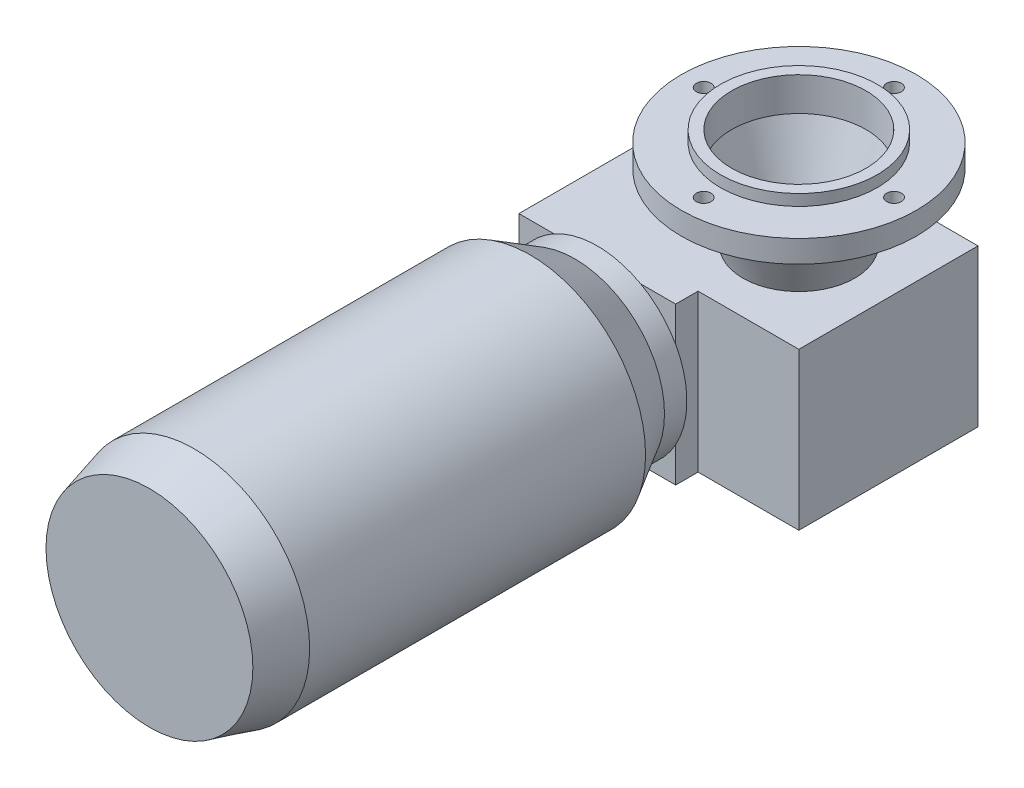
ISO-10303-21;
HEADER;
FILE_DESCRIPTION(('STEP AP214'),'2;1');
FILE_NAME('part.step','',(''),(''),'','','');
FILE_SCHEMA(('AUTOMOTIVE_DESIGN { 1 0 10303 214 1 1 1 1 }'));
ENDSEC;
DATA;
#1=APPLICATION_CONTEXT('core data for automotive mechanical design processes');
#2=APPLICATION_PROTOCOL_DEFINITION('international standard','automotive_design',2000,#1);
#3=PRODUCT_CONTEXT('',#1,'mechanical');
#4=PRODUCT('Part','Part','',(#3));
#5=PRODUCT_RELATED_PRODUCT_CATEGORY('part','',(#4));
#6=PRODUCT_DEFINITION_FORMATION('','',#4);
#7=PRODUCT_DEFINITION_CONTEXT('part definition',#1,'design');
#8=PRODUCT_DEFINITION('design','',#6,#7);
#9=PRODUCT_DEFINITION_SHAPE('','',#8);
#10=(LENGTH_UNIT() NAMED_UNIT(*) SI_UNIT(.MILLI.,.METRE.));
#11=(NAMED_UNIT(*) PLANE_ANGLE_UNIT() SI_UNIT($,.RADIAN.));
#12=(NAMED_UNIT(*) SI_UNIT($,.STERADIAN.) SOLID_ANGLE_UNIT());
#13=UNCERTAINTY_MEASURE_WITH_UNIT(LENGTH_MEASURE(1.E-05),#10,'distance_accuracy_value','');
#14=(GEOMETRIC_REPRESENTATION_CONTEXT(3) GLOBAL_UNCERTAINTY_ASSIGNED_CONTEXT((#13)) GLOBAL_UNIT_ASSIGNED_CONTEXT((#10,
#11,#12)) REPRESENTATION_CONTEXT('',''));
#15=CARTESIAN_POINT('',(0.,0.,0.));
#16=DIRECTION('',(0.,0.,1.));
#17=DIRECTION('',(1.,0.,0.));
#18=AXIS2_PLACEMENT_3D('',#15,#16,#17);
#19=CARTESIAN_POINT('',(-5.,-115.,-40.));
#20=DIRECTION('',(0.,1.,0.));
#21=DIRECTION('',(0.,0.,1.));
#22=AXIS2_PLACEMENT_3D('',#19,#20,#21);
#23=PLANE('',#22);
#24=DIRECTION('',(1.,0.,0.));
#25=VECTOR('',#24,1.);
#26=CARTESIAN_POINT('',(-5.,-115.,-40.));
#27=LINE('',#26,#25);
#28=CARTESIAN_POINT('',(-5.,-115.,-40.));
#29=VERTEX_POINT('',#28);
#30=CARTESIAN_POINT('',(40.,-115.,-40.));
#31=VERTEX_POINT('',#30);
#32=EDGE_CURVE('E197',#29,#31,#27,.T.);
#33=ORIENTED_EDGE('',*,*,#32,.T.);
#34=DIRECTION('',(0.,0.,1.));
#35=VECTOR('',#34,1.);
#36=CARTESIAN_POINT('',(40.,-115.,-40.));
#37=LINE('',#36,#35);
#38=CARTESIAN_POINT('',(40.,-115.,40.));
#39=VERTEX_POINT('',#38);
#40=EDGE_CURVE('E200',#31,#39,#37,.T.);
#41=ORIENTED_EDGE('',*,*,#40,.T.);
#42=DIRECTION('',(-1.,0.,0.));
#43=VECTOR('',#42,1.);
#44=CARTESIAN_POINT('',(40.,-115.,40.));
#45=LINE('',#44,#43);
#46=CARTESIAN_POINT('',(-5.,-115.,40.));
#47=VERTEX_POINT('',#46);
#48=EDGE_CURVE('E202',#39,#47,#45,.T.);
#49=ORIENTED_EDGE('',*,*,#48,.T.);
#50=DIRECTION('',(0.,0.,1.));
#51=VECTOR('',#50,1.);
#52=CARTESIAN_POINT('',(-5.,-115.,40.));
#53=LINE('',#52,#51);
#54=CARTESIAN_POINT('',(-5.,-115.,50.));
#55=VERTEX_POINT('',#54);
#56=EDGE_CURVE('E204',#47,#55,#53,.T.);
#57=ORIENTED_EDGE('',*,*,#56,.T.);
#58=DIRECTION('',(-1.,0.,0.));
#59=VECTOR('',#58,1.);
#60=CARTESIAN_POINT('',(-5.,-115.,50.));
#61=LINE('',#60,#59);
#62=CARTESIAN_POINT('',(-20.6350832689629,-115.,50.));
#63=VERTEX_POINT('',#62);
#64=EDGE_CURVE('E128',#55,#63,#61,.T.);
#65=ORIENTED_EDGE('',*,*,#64,.T.);
#66=CARTESIAN_POINT('',(-59.3649167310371,-115.,50.));
#67=VERTEX_POINT('',#66);
#68=EDGE_CURVE('E208',#63,#67,#61,.T.);
#69=ORIENTED_EDGE('',*,*,#68,.T.);
#70=CARTESIAN_POINT('',(-75.,-115.,50.));
#71=VERTEX_POINT('',#70);
#72=EDGE_CURVE('E55',#67,#71,#61,.T.);
#73=ORIENTED_EDGE('',*,*,#72,.T.);
#74=DIRECTION('',(0.,0.,-1.));
#75=VECTOR('',#74,1.);
#76=CARTESIAN_POINT('',(-75.,-115.,-60.));
#77=LINE('',#76,#75);
#78=CARTESIAN_POINT('',(-75.,-115.,-60.));
#79=VERTEX_POINT('',#78);
#80=EDGE_CURVE('E207',#71,#79,#77,.T.);
#81=ORIENTED_EDGE('',*,*,#80,.T.);
#82=DIRECTION('',(1.,0.,0.));
#83=VECTOR('',#82,1.);
#84=CARTESIAN_POINT('',(-4.99999999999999,-115.,-60.));
#85=LINE('',#84,#83);
#86=CARTESIAN_POINT('',(-4.99999999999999,-115.,-60.));
#87=VERTEX_POINT('',#86);
#88=EDGE_CURVE('E210',#79,#87,#85,.T.);
#89=ORIENTED_EDGE('',*,*,#88,.T.);
#90=DIRECTION('',(0.,0.,1.));
#91=VECTOR('',#90,1.);
#92=CARTESIAN_POINT('',(-5.,-115.,-40.));
#93=LINE('',#92,#91);
#94=EDGE_CURVE('E212',#87,#29,#93,.T.);
#95=ORIENTED_EDGE('',*,*,#94,.T.);
#96=EDGE_LOOP('',(#33,#41,#49,#57,#65,#69,#73,#81,#89,#95));
#97=FACE_BOUND('',#96,.T.);
#98=CARTESIAN_POINT('',(0.,-115.,0.));
#99=DIRECTION('',(0.,1.,0.));
#100=DIRECTION('',(0.,0.,1.));
#101=AXIS2_PLACEMENT_3D('',#98,#99,#100);
#102=CIRCLE('',#101,20.);
#103=CARTESIAN_POINT('',(0.,-115.,20.));
#104=VERTEX_POINT('',#103);
#105=EDGE_CURVE('E11',#104,#104,#102,.F.);
#106=ORIENTED_EDGE('',*,*,#105,.F.);
#107=EDGE_LOOP('',(#106));
#108=FACE_BOUND('',#107,.T.);
#109=ADVANCED_FACE('F32',(#97,#108),#23,.F.);
#110=CARTESIAN_POINT('',(-5.,-115.,50.));
#111=DIRECTION('',(0.,0.,-1.));
#112=DIRECTION('',(-1.,0.,0.));
#113=AXIS2_PLACEMENT_3D('',#110,#111,#112);
#114=PLANE('',#113);
#115=CARTESIAN_POINT('',(-40.,-80.,50.));
#116=DIRECTION('',(0.,0.,1.));
#117=DIRECTION('',(1.,0.,0.));
#118=AXIS2_PLACEMENT_3D('',#115,#116,#117);
#119=CIRCLE('',#118,40.);
#120=CARTESIAN_POINT('',(-5.,-60.6350832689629,50.));
#121=VERTEX_POINT('',#120);
#122=CARTESIAN_POINT('',(-20.6350832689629,-45.,50.));
#123=VERTEX_POINT('',#122);
#124=EDGE_CURVE('E47',#121,#123,#119,.T.);
#125=ORIENTED_EDGE('',*,*,#124,.F.);
#126=DIRECTION('',(0.,1.,0.));
#127=VECTOR('',#126,1.);
#128=CARTESIAN_POINT('',(-5.,-115.,50.));
#129=LINE('',#128,#127);
#130=CARTESIAN_POINT('',(-5.,-45.,50.));
#131=VERTEX_POINT('',#130);
#132=EDGE_CURVE('E134',#121,#131,#129,.T.);
#133=ORIENTED_EDGE('',*,*,#132,.T.);
#134=DIRECTION('',(-1.,0.,0.));
#135=VECTOR('',#134,1.);
#136=CARTESIAN_POINT('',(-5.,-45.,50.));
#137=LINE('',#136,#135);
#138=EDGE_CURVE('E186',#131,#123,#137,.T.);
#139=ORIENTED_EDGE('',*,*,#138,.T.);
#140=EDGE_LOOP('',(#125,#133,#139));
#141=FACE_BOUND('',#140,.T.);
#142=ADVANCED_FACE('F336',(#141),#114,.F.);
#143=CARTESIAN_POINT('',(-59.3649167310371,-45.,50.));
#144=VERTEX_POINT('',#143);
#145=CARTESIAN_POINT('',(-75.,-60.6350832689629,50.));
#146=VERTEX_POINT('',#145);
#147=EDGE_CURVE('E40',#144,#146,#119,.T.);
#148=ORIENTED_EDGE('',*,*,#147,.F.);
#149=CARTESIAN_POINT('',(-75.,-45.,50.));
#150=VERTEX_POINT('',#149);
#151=EDGE_CURVE('E171',#144,#150,#137,.T.);
#152=ORIENTED_EDGE('',*,*,#151,.T.);
#153=DIRECTION('',(0.,1.,0.));
#154=VECTOR('',#153,1.);
#155=CARTESIAN_POINT('',(-75.,-115.,50.));
#156=LINE('',#155,#154);
#157=EDGE_CURVE('E173',#146,#150,#156,.T.);
#158=ORIENTED_EDGE('',*,*,#157,.F.);
#159=EDGE_LOOP('',(#148,#152,#158));
#160=FACE_BOUND('',#159,.T.);
#161=ADVANCED_FACE('F170',(#160),#114,.F.);
#162=CARTESIAN_POINT('',(-75.,-99.3649167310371,50.));
#163=VERTEX_POINT('',#162);
#164=EDGE_CURVE('E151',#163,#67,#119,.T.);
#165=ORIENTED_EDGE('',*,*,#164,.F.);
#166=EDGE_CURVE('E223',#71,#163,#156,.T.);
#167=ORIENTED_EDGE('',*,*,#166,.F.);
#168=ORIENTED_EDGE('',*,*,#72,.F.);
#169=EDGE_LOOP('',(#165,#167,#168));
#170=FACE_BOUND('',#169,.T.);
#171=ADVANCED_FACE('F492',(#170),#114,.F.);
#172=CARTESIAN_POINT('',(-5.,-99.3649167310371,50.));
#173=VERTEX_POINT('',#172);
#174=EDGE_CURVE('E126',#63,#173,#119,.T.);
#175=ORIENTED_EDGE('',*,*,#174,.F.);
#176=ORIENTED_EDGE('',*,*,#64,.F.);
#177=EDGE_CURVE('E122',#55,#173,#129,.T.);
#178=ORIENTED_EDGE('',*,*,#177,.T.);
#179=EDGE_LOOP('',(#175,#176,#178));
#180=FACE_BOUND('',#179,.T.);
#181=ADVANCED_FACE('F124',(#180),#114,.F.);
#182=CARTESIAN_POINT('',(35.,-5.,0.));
#183=DIRECTION('',(0.,-1.,0.));
#184=DIRECTION('',(0.,0.,-1.));
#185=AXIS2_PLACEMENT_3D('',#182,#183,#184);
#186=PLANE('',#185);
#187=CARTESIAN_POINT('',(42.5,-5.,0.));
#188=DIRECTION('',(0.,1.,0.));
#189=DIRECTION('',(0.,0.,1.));
#190=AXIS2_PLACEMENT_3D('',#187,#188,#189);
#191=CIRCLE('',#190,3.29999999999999);
#192=CARTESIAN_POINT('',(42.5,-5.,3.29999999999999));
#193=VERTEX_POINT('',#192);
#194=EDGE_CURVE('E244',#193,#193,#191,.T.);
#195=ORIENTED_EDGE('',*,*,#194,.F.);
#196=EDGE_LOOP('',(#195));
#197=FACE_BOUND('',#196,.T.);
#198=CARTESIAN_POINT('',(0.,-5.,42.5));
#199=DIRECTION('',(0.,1.,0.));
#200=DIRECTION('',(0.,0.,1.));
#201=AXIS2_PLACEMENT_3D('',#198,#199,#200);
#202=CIRCLE('',#201,3.29999999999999);
#203=CARTESIAN_POINT('',(0.,-5.,45.8));
#204=VERTEX_POINT('',#203);
#205=EDGE_CURVE('E256',#204,#204,#202,.T.);
#206=ORIENTED_EDGE('',*,*,#205,.F.);
#207=EDGE_LOOP('',(#206));
#208=FACE_BOUND('',#207,.T.);
#209=CARTESIAN_POINT('',(0.,-5.,0.));
#210=DIRECTION('',(0.,1.,0.));
#211=DIRECTION('',(0.,0.,1.));
#212=AXIS2_PLACEMENT_3D('',#209,#210,#211);
#213=CIRCLE('',#212,35.);
#214=CARTESIAN_POINT('',(0.,-5.,35.));
#215=VERTEX_POINT('',#214);
#216=EDGE_CURVE('E268',#215,#215,#213,.T.);
#217=ORIENTED_EDGE('',*,*,#216,.F.);
#218=EDGE_LOOP('',(#217));
#219=FACE_BOUND('',#218,.T.);
#220=CARTESIAN_POINT('',(0.,-5.,0.));
#221=DIRECTION('',(0.,1.,0.));
#222=DIRECTION('',(0.,0.,1.));
#223=AXIS2_PLACEMENT_3D('',#220,#221,#222);
#224=CIRCLE('',#223,52.5);
#225=CARTESIAN_POINT('',(0.,-5.,52.5));
#226=VERTEX_POINT('',#225);
#227=EDGE_CURVE('E271',#226,#226,#224,.T.);
#228=ORIENTED_EDGE('',*,*,#227,.T.);
#229=EDGE_LOOP('',(#228));
#230=FACE_BOUND('',#229,.T.);
#231=CARTESIAN_POINT('',(0.,-5.,-42.5));
#232=DIRECTION('',(0.,1.,0.));
#233=DIRECTION('',(0.,0.,1.));
#234=AXIS2_PLACEMENT_3D('',#231,#232,#233);
#235=CIRCLE('',#234,3.29999999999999);
#236=CARTESIAN_POINT('',(0.,-5.,-39.2));
#237=VERTEX_POINT('',#236);
#238=EDGE_CURVE('E250',#237,#237,#235,.T.);
#239=ORIENTED_EDGE('',*,*,#238,.F.);
#240=EDGE_LOOP('',(#239));
#241=FACE_BOUND('',#240,.T.);
#242=CARTESIAN_POINT('',(-42.5,-5.,0.));
#243=DIRECTION('',(0.,1.,0.));
#244=DIRECTION('',(0.,0.,1.));
#245=AXIS2_PLACEMENT_3D('',#242,#243,#244);
#246=CIRCLE('',#245,3.29999999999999);
#247=CARTESIAN_POINT('',(-42.5,-5.,3.29999999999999));
#248=VERTEX_POINT('',#247);
#249=EDGE_CURVE('E238',#248,#248,#246,.T.);
#250=ORIENTED_EDGE('',*,*,#249,.F.);
#251=EDGE_LOOP('',(#250));
#252=FACE_BOUND('',#251,.T.);
#253=ADVANCED_FACE('F292',(#197,#208,#219,#230,#241,#252),#186,.F.);
#254=CARTESIAN_POINT('',(0.,32.3842170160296,0.));
#255=DIRECTION('',(0.,1.,0.));
#256=DIRECTION('',(0.,0.,1.));
#257=AXIS2_PLACEMENT_3D('',#254,#255,#256);
#258=CYLINDRICAL_SURFACE('',#257,30.);
#259=CARTESIAN_POINT('',(0.,-15.,0.));
#260=DIRECTION('',(0.,1.,0.));
#261=DIRECTION('',(0.,0.,1.));
#262=AXIS2_PLACEMENT_3D('',#259,#260,#261);
#263=CIRCLE('',#262,30.);
#264=CARTESIAN_POINT('',(0.,-15.,30.));
#265=VERTEX_POINT('',#264);
#266=EDGE_CURVE('E152',#265,#265,#263,.T.);
#267=ORIENTED_EDGE('',*,*,#266,.F.);
#268=EDGE_LOOP('',(#267));
#269=FACE_BOUND('',#268,.T.);
#270=CARTESIAN_POINT('',(0.,0.,0.));
#271=DIRECTION('',(0.,1.,0.));
#272=DIRECTION('',(0.,0.,1.));
#273=AXIS2_PLACEMENT_3D('',#270,#271,#272);
#274=CIRCLE('',#273,30.);
#275=CARTESIAN_POINT('',(0.,0.,30.));
#276=VERTEX_POINT('',#275);
#277=EDGE_CURVE('E262',#276,#276,#274,.T.);
#278=ORIENTED_EDGE('',*,*,#277,.T.);
#279=EDGE_LOOP('',(#278));
#280=FACE_BOUND('',#279,.T.);
#281=ADVANCED_FACE('F34',(#269,#280),#258,.F.);
#282=CARTESIAN_POINT('',(0.,-15.,0.));
#283=DIRECTION('',(0.,1.,0.));
#284=DIRECTION('',(0.,0.,1.));
#285=AXIS2_PLACEMENT_3D('',#282,#283,#284);
#286=CONICAL_SURFACE('',#285,30.,0.345555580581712);
#287=CARTESIAN_POINT('',(0.,-40.,0.));
#288=DIRECTION('',(0.,1.,0.));
#289=DIRECTION('',(0.,0.,1.));
#290=AXIS2_PLACEMENT_3D('',#287,#288,#289);
#291=CIRCLE('',#290,21.);
#292=CARTESIAN_POINT('',(0.,-40.,21.));
#293=VERTEX_POINT('',#292);
#294=EDGE_CURVE('E154',#293,#293,#291,.T.);
#295=ORIENTED_EDGE('',*,*,#294,.F.);
#296=EDGE_LOOP('',(#295));
#297=FACE_BOUND('',#296,.T.);
#298=ORIENTED_EDGE('',*,*,#266,.T.);
#299=EDGE_LOOP('',(#298));
#300=FACE_BOUND('',#299,.T.);
#301=ADVANCED_FACE('F285',(#297,#300),#286,.F.);
#302=CARTESIAN_POINT('',(0.,-40.,0.));
#303=DIRECTION('',(0.,-1.,0.));
#304=DIRECTION('',(0.,0.,-1.));
#305=AXIS2_PLACEMENT_3D('',#302,#303,#304);
#306=PLANE('',#305);
#307=ORIENTED_EDGE('',*,*,#294,.T.);
#308=EDGE_LOOP('',(#307));
#309=FACE_BOUND('',#308,.T.);
#310=ADVANCED_FACE('F283',(#309),#306,.F.);
#311=CARTESIAN_POINT('',(0.,-45.,0.));
#312=DIRECTION('',(0.,1.,0.));
#313=DIRECTION('',(0.,0.,1.));
#314=AXIS2_PLACEMENT_3D('',#311,#312,#313);
#315=CONICAL_SURFACE('',#314,25.,0.345555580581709);
#316=CARTESIAN_POINT('',(0.,-15.0000000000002,0.));
#317=DIRECTION('',(0.,1.,0.));
#318=DIRECTION('',(0.,0.,1.));
#319=AXIS2_PLACEMENT_3D('',#316,#317,#318);
#320=CIRCLE('',#319,35.7999999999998);
#321=CARTESIAN_POINT('',(0.,-15.0000000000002,35.7999999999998));
#322=VERTEX_POINT('',#321);
#323=EDGE_CURVE('E277',#322,#322,#320,.T.);
#324=ORIENTED_EDGE('',*,*,#323,.F.);
#325=EDGE_LOOP('',(#324));
#326=FACE_BOUND('',#325,.T.);
#327=CARTESIAN_POINT('',(0.,-45.,0.));
#328=DIRECTION('',(0.,1.,0.));
#329=DIRECTION('',(0.,0.,1.));
#330=AXIS2_PLACEMENT_3D('',#327,#328,#329);
#331=CIRCLE('',#330,25.);
#332=CARTESIAN_POINT('',(0.,-45.,25.));
#333=VERTEX_POINT('',#332);
#334=EDGE_CURVE('E235',#333,#333,#331,.T.);
#335=ORIENTED_EDGE('',*,*,#334,.T.);
#336=EDGE_LOOP('',(#335));
#337=FACE_BOUND('',#336,.T.);
#338=ADVANCED_FACE('F535',(#326,#337),#315,.T.);
#339=CARTESIAN_POINT('',(52.5,-15.,0.));
#340=DIRECTION('',(0.,1.,0.));
#341=DIRECTION('',(0.,0.,1.));
#342=AXIS2_PLACEMENT_3D('',#339,#340,#341);
#343=PLANE('',#342);
#344=CARTESIAN_POINT('',(-42.5,-15.,0.));
#345=DIRECTION('',(0.,1.,0.));
#346=DIRECTION('',(0.,0.,1.));
#347=AXIS2_PLACEMENT_3D('',#344,#345,#346);
#348=CIRCLE('',#347,3.29999999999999);
#349=CARTESIAN_POINT('',(-42.5,-15.,3.29999999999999));
#350=VERTEX_POINT('',#349);
#351=EDGE_CURVE('E241',#350,#350,#348,.T.);
#352=ORIENTED_EDGE('',*,*,#351,.T.);
#353=EDGE_LOOP('',(#352));
#354=FACE_BOUND('',#353,.T.);
#355=CARTESIAN_POINT('',(42.5,-15.,0.));
#356=DIRECTION('',(0.,1.,0.));
#357=DIRECTION('',(0.,0.,1.));
#358=AXIS2_PLACEMENT_3D('',#355,#356,#357);
#359=CIRCLE('',#358,3.29999999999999);
#360=CARTESIAN_POINT('',(42.5,-15.,3.29999999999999));
#361=VERTEX_POINT('',#360);
#362=EDGE_CURVE('E247',#361,#361,#359,.T.);
#363=ORIENTED_EDGE('',*,*,#362,.T.);
#364=EDGE_LOOP('',(#363));
#365=FACE_BOUND('',#364,.T.);
#366=CARTESIAN_POINT('',(0.,-15.,-42.5));
#367=DIRECTION('',(0.,1.,0.));
#368=DIRECTION('',(0.,0.,1.));
#369=AXIS2_PLACEMENT_3D('',#366,#367,#368);
#370=CIRCLE('',#369,3.29999999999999);
#371=CARTESIAN_POINT('',(0.,-15.,-39.2));
#372=VERTEX_POINT('',#371);
#373=EDGE_CURVE('E253',#372,#372,#370,.T.);
#374=ORIENTED_EDGE('',*,*,#373,.T.);
#375=EDGE_LOOP('',(#374));
#376=FACE_BOUND('',#375,.T.);
#377=CARTESIAN_POINT('',(0.,-15.,42.5));
#378=DIRECTION('',(0.,1.,0.));
#379=DIRECTION('',(0.,0.,1.));
#380=AXIS2_PLACEMENT_3D('',#377,#378,#379);
#381=CIRCLE('',#380,3.29999999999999);
#382=CARTESIAN_POINT('',(0.,-15.,45.8));
#383=VERTEX_POINT('',#382);
#384=EDGE_CURVE('E259',#383,#383,#381,.T.);
#385=ORIENTED_EDGE('',*,*,#384,.T.);
#386=EDGE_LOOP('',(#385));
#387=FACE_BOUND('',#386,.T.);
#388=CARTESIAN_POINT('',(0.,-15.,0.));
#389=DIRECTION('',(0.,1.,0.));
#390=DIRECTION('',(0.,0.,1.));
#391=AXIS2_PLACEMENT_3D('',#388,#389,#390);
#392=CIRCLE('',#391,52.5);
#393=CARTESIAN_POINT('',(0.,-15.,52.5));
#394=VERTEX_POINT('',#393);
#395=EDGE_CURVE('E274',#394,#394,#392,.T.);
#396=ORIENTED_EDGE('',*,*,#395,.F.);
#397=EDGE_LOOP('',(#396));
#398=FACE_BOUND('',#397,.T.);
#399=ORIENTED_EDGE('',*,*,#323,.T.);
#400=EDGE_LOOP('',(#399));
#401=FACE_BOUND('',#400,.T.);
#402=ADVANCED_FACE('F544',(#354,#365,#376,#387,#398,#401),#343,.F.);
#403=CARTESIAN_POINT('',(0.,32.3842170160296,0.));
#404=DIRECTION('',(0.,1.,0.));
#405=DIRECTION('',(0.,0.,1.));
#406=AXIS2_PLACEMENT_3D('',#403,#404,#405);
#407=CYLINDRICAL_SURFACE('',#406,52.5);
#408=ORIENTED_EDGE('',*,*,#227,.F.);
#409=EDGE_LOOP('',(#408));
#410=FACE_BOUND('',#409,.T.);
#411=ORIENTED_EDGE('',*,*,#395,.T.);
#412=EDGE_LOOP('',(#411));
#413=FACE_BOUND('',#412,.T.);
#414=ADVANCED_FACE('F305',(#410,#413),#407,.T.);
#415=CARTESIAN_POINT('',(0.,32.3842170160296,0.));
#416=DIRECTION('',(0.,1.,0.));
#417=DIRECTION('',(0.,0.,1.));
#418=AXIS2_PLACEMENT_3D('',#415,#416,#417);
#419=CYLINDRICAL_SURFACE('',#418,35.);
#420=CARTESIAN_POINT('',(0.,0.,0.));
#421=DIRECTION('',(0.,1.,0.));
#422=DIRECTION('',(0.,0.,1.));
#423=AXIS2_PLACEMENT_3D('',#420,#421,#422);
#424=CIRCLE('',#423,35.);
#425=CARTESIAN_POINT('',(0.,0.,35.));
#426=VERTEX_POINT('',#425);
#427=EDGE_CURVE('E265',#426,#426,#424,.T.);
#428=ORIENTED_EDGE('',*,*,#427,.F.);
#429=EDGE_LOOP('',(#428));
#430=FACE_BOUND('',#429,.T.);
#431=ORIENTED_EDGE('',*,*,#216,.T.);
#432=EDGE_LOOP('',(#431));
#433=FACE_BOUND('',#432,.T.);
#434=ADVANCED_FACE('F299',(#430,#433),#419,.T.);
#435=CARTESIAN_POINT('',(30.,0.,0.));
#436=DIRECTION('',(0.,-1.,0.));
#437=DIRECTION('',(0.,0.,-1.));
#438=AXIS2_PLACEMENT_3D('',#435,#436,#437);
#439=PLANE('',#438);
#440=ORIENTED_EDGE('',*,*,#277,.F.);
#441=EDGE_LOOP('',(#440));
#442=FACE_BOUND('',#441,.T.);
#443=ORIENTED_EDGE('',*,*,#427,.T.);
#444=EDGE_LOOP('',(#443));
#445=FACE_BOUND('',#444,.T.);
#446=ADVANCED_FACE('F295',(#442,#445),#439,.F.);
#447=CARTESIAN_POINT('',(0.,-5.,42.5));
#448=DIRECTION('',(0.,1.,0.));
#449=DIRECTION('',(0.,0.,1.));
#450=AXIS2_PLACEMENT_3D('',#447,#448,#449);
#451=CYLINDRICAL_SURFACE('',#450,3.29999999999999);
#452=ORIENTED_EDGE('',*,*,#384,.F.);
#453=EDGE_LOOP('',(#452));
#454=FACE_BOUND('',#453,.T.);
#455=ORIENTED_EDGE('',*,*,#205,.T.);
#456=EDGE_LOOP('',(#455));
#457=FACE_BOUND('',#456,.T.);
#458=ADVANCED_FACE('F298',(#454,#457),#451,.F.);
#459=CARTESIAN_POINT('',(0.,-5.,-42.5));
#460=DIRECTION('',(0.,1.,0.));
#461=DIRECTION('',(0.,0.,1.));
#462=AXIS2_PLACEMENT_3D('',#459,#460,#461);
#463=CYLINDRICAL_SURFACE('',#462,3.29999999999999);
#464=ORIENTED_EDGE('',*,*,#373,.F.);
#465=EDGE_LOOP('',(#464));
#466=FACE_BOUND('',#465,.T.);
#467=ORIENTED_EDGE('',*,*,#238,.T.);
#468=EDGE_LOOP('',(#467));
#469=FACE_BOUND('',#468,.T.);
#470=ADVANCED_FACE('F330',(#466,#469),#463,.F.);
#471=CARTESIAN_POINT('',(42.5,-5.,0.));
#472=DIRECTION('',(0.,1.,0.));
#473=DIRECTION('',(0.,0.,1.));
#474=AXIS2_PLACEMENT_3D('',#471,#472,#473);
#475=CYLINDRICAL_SURFACE('',#474,3.29999999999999);
#476=ORIENTED_EDGE('',*,*,#362,.F.);
#477=EDGE_LOOP('',(#476));
#478=FACE_BOUND('',#477,.T.);
#479=ORIENTED_EDGE('',*,*,#194,.T.);
#480=EDGE_LOOP('',(#479));
#481=FACE_BOUND('',#480,.T.);
#482=ADVANCED_FACE('F321',(#478,#481),#475,.F.);
#483=CARTESIAN_POINT('',(-42.5,-5.,0.));
#484=DIRECTION('',(0.,1.,0.));
#485=DIRECTION('',(0.,0.,1.));
#486=AXIS2_PLACEMENT_3D('',#483,#484,#485);
#487=CYLINDRICAL_SURFACE('',#486,3.29999999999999);
#488=ORIENTED_EDGE('',*,*,#351,.F.);
#489=EDGE_LOOP('',(#488));
#490=FACE_BOUND('',#489,.T.);
#491=ORIENTED_EDGE('',*,*,#249,.T.);
#492=EDGE_LOOP('',(#491));
#493=FACE_BOUND('',#492,.T.);
#494=ADVANCED_FACE('F319',(#490,#493),#487,.F.);
#495=CARTESIAN_POINT('',(-5.,-45.,-40.));
#496=DIRECTION('',(0.,1.,0.));
#497=DIRECTION('',(0.,0.,1.));
#498=AXIS2_PLACEMENT_3D('',#495,#496,#497);
#499=PLANE('',#498);
#500=DIRECTION('',(1.,0.,0.));
#501=VECTOR('',#500,1.);
#502=CARTESIAN_POINT('',(-5.,-45.,-40.));
#503=LINE('',#502,#501);
#504=CARTESIAN_POINT('',(-5.,-45.,-40.));
#505=VERTEX_POINT('',#504);
#506=CARTESIAN_POINT('',(40.,-45.,-40.));
#507=VERTEX_POINT('',#506);
#508=EDGE_CURVE('E161',#505,#507,#503,.T.);
#509=ORIENTED_EDGE('',*,*,#508,.F.);
#510=DIRECTION('',(0.,0.,1.));
#511=VECTOR('',#510,1.);
#512=CARTESIAN_POINT('',(-5.,-45.,-40.));
#513=LINE('',#512,#511);
#514=CARTESIAN_POINT('',(-4.99999999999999,-45.,-60.));
#515=VERTEX_POINT('',#514);
#516=EDGE_CURVE('E195',#515,#505,#513,.T.);
#517=ORIENTED_EDGE('',*,*,#516,.F.);
#518=DIRECTION('',(1.,0.,0.));
#519=VECTOR('',#518,1.);
#520=CARTESIAN_POINT('',(-4.99999999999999,-45.,-60.));
#521=LINE('',#520,#519);
#522=CARTESIAN_POINT('',(-75.,-45.,-60.));
#523=VERTEX_POINT('',#522);
#524=EDGE_CURVE('E193',#523,#515,#521,.T.);
#525=ORIENTED_EDGE('',*,*,#524,.F.);
#526=DIRECTION('',(0.,0.,-1.));
#527=VECTOR('',#526,1.);
#528=CARTESIAN_POINT('',(-75.,-45.,-60.));
#529=LINE('',#528,#527);
#530=EDGE_CURVE('E183',#150,#523,#529,.T.);
#531=ORIENTED_EDGE('',*,*,#530,.F.);
#532=ORIENTED_EDGE('',*,*,#151,.F.);
#533=EDGE_CURVE('E181',#123,#144,#137,.T.);
#534=ORIENTED_EDGE('',*,*,#533,.F.);
#535=ORIENTED_EDGE('',*,*,#138,.F.);
#536=DIRECTION('',(0.,0.,1.));
#537=VECTOR('',#536,1.);
#538=CARTESIAN_POINT('',(-5.,-45.,40.));
#539=LINE('',#538,#537);
#540=CARTESIAN_POINT('',(-5.,-45.,40.));
#541=VERTEX_POINT('',#540);
#542=EDGE_CURVE('E184',#541,#131,#539,.T.);
#543=ORIENTED_EDGE('',*,*,#542,.F.);
#544=DIRECTION('',(-1.,0.,0.));
#545=VECTOR('',#544,1.);
#546=CARTESIAN_POINT('',(40.,-45.,40.));
#547=LINE('',#546,#545);
#548=CARTESIAN_POINT('',(40.,-45.,40.));
#549=VERTEX_POINT('',#548);
#550=EDGE_CURVE('E378',#549,#541,#547,.T.);
#551=ORIENTED_EDGE('',*,*,#550,.F.);
#552=DIRECTION('',(0.,0.,1.));
#553=VECTOR('',#552,1.);
#554=CARTESIAN_POINT('',(40.,-45.,-40.));
#555=LINE('',#554,#553);
#556=EDGE_CURVE('E376',#507,#549,#555,.T.);
#557=ORIENTED_EDGE('',*,*,#556,.F.);
#558=EDGE_LOOP('',(#509,#517,#525,#531,#532,#534,#535,#543,#551,#557));
#559=FACE_BOUND('',#558,.T.);
#560=ORIENTED_EDGE('',*,*,#334,.F.);
#561=EDGE_LOOP('',(#560));
#562=FACE_BOUND('',#561,.T.);
#563=ADVANCED_FACE('F178',(#559,#562),#499,.T.);
#564=CARTESIAN_POINT('',(-5.,-115.,-40.));
#565=DIRECTION('',(0.,0.,1.));
#566=DIRECTION('',(1.,0.,0.));
#567=AXIS2_PLACEMENT_3D('',#564,#565,#566);
#568=PLANE('',#567);
#569=ORIENTED_EDGE('',*,*,#508,.T.);
#570=DIRECTION('',(0.,1.,0.));
#571=VECTOR('',#570,1.);
#572=CARTESIAN_POINT('',(40.,-115.,-40.));
#573=LINE('',#572,#571);
#574=EDGE_CURVE('E232',#31,#507,#573,.T.);
#575=ORIENTED_EDGE('',*,*,#574,.F.);
#576=ORIENTED_EDGE('',*,*,#32,.F.);
#577=DIRECTION('',(0.,1.,0.));
#578=VECTOR('',#577,1.);
#579=CARTESIAN_POINT('',(-5.,-115.,-40.));
#580=LINE('',#579,#578);
#581=EDGE_CURVE('E214',#29,#505,#580,.T.);
#582=ORIENTED_EDGE('',*,*,#581,.T.);
#583=EDGE_LOOP('',(#569,#575,#576,#582));
#584=FACE_BOUND('',#583,.T.);
#585=ADVANCED_FACE('F328',(#584),#568,.F.);
#586=CARTESIAN_POINT('',(40.,-115.,-40.));
#587=DIRECTION('',(-1.,0.,0.));
#588=DIRECTION('',(0.,0.,1.));
#589=AXIS2_PLACEMENT_3D('',#586,#587,#588);
#590=PLANE('',#589);
#591=ORIENTED_EDGE('',*,*,#556,.T.);
#592=DIRECTION('',(0.,1.,0.));
#593=VECTOR('',#592,1.);
#594=CARTESIAN_POINT('',(40.,-115.,40.));
#595=LINE('',#594,#593);
#596=EDGE_CURVE('E229',#39,#549,#595,.T.);
#597=ORIENTED_EDGE('',*,*,#596,.F.);
#598=ORIENTED_EDGE('',*,*,#40,.F.);
#599=ORIENTED_EDGE('',*,*,#574,.T.);
#600=EDGE_LOOP('',(#591,#597,#598,#599));
#601=FACE_BOUND('',#600,.T.);
#602=ADVANCED_FACE('F363',(#601),#590,.F.);
#603=CARTESIAN_POINT('',(40.,-115.,40.));
#604=DIRECTION('',(0.,0.,-1.));
#605=DIRECTION('',(-1.,0.,0.));
#606=AXIS2_PLACEMENT_3D('',#603,#604,#605);
#607=PLANE('',#606);
#608=ORIENTED_EDGE('',*,*,#550,.T.);
#609=DIRECTION('',(0.,1.,0.));
#610=VECTOR('',#609,1.);
#611=CARTESIAN_POINT('',(-5.,-115.,40.));
#612=LINE('',#611,#610);
#613=EDGE_CURVE('E131',#47,#541,#612,.T.);
#614=ORIENTED_EDGE('',*,*,#613,.F.);
#615=ORIENTED_EDGE('',*,*,#48,.F.);
#616=ORIENTED_EDGE('',*,*,#596,.T.);
#617=EDGE_LOOP('',(#608,#614,#615,#616));
#618=FACE_BOUND('',#617,.T.);
#619=ADVANCED_FACE('F360',(#618),#607,.F.);
#620=CARTESIAN_POINT('',(-5.,-115.,40.));
#621=DIRECTION('',(-1.,0.,0.));
#622=DIRECTION('',(0.,0.,1.));
#623=AXIS2_PLACEMENT_3D('',#620,#621,#622);
#624=PLANE('',#623);
#625=ORIENTED_EDGE('',*,*,#542,.T.);
#626=ORIENTED_EDGE('',*,*,#132,.F.);
#627=EDGE_CURVE('E132',#173,#121,#129,.T.);
#628=ORIENTED_EDGE('',*,*,#627,.F.);
#629=ORIENTED_EDGE('',*,*,#177,.F.);
#630=ORIENTED_EDGE('',*,*,#56,.F.);
#631=ORIENTED_EDGE('',*,*,#613,.T.);
#632=EDGE_LOOP('',(#625,#626,#628,#629,#630,#631));
#633=FACE_BOUND('',#632,.T.);
#634=ADVANCED_FACE('F138',(#633),#624,.F.);
#635=CARTESIAN_POINT('',(-75.,-115.,-60.));
#636=DIRECTION('',(1.,0.,0.));
#637=DIRECTION('',(0.,0.,-1.));
#638=AXIS2_PLACEMENT_3D('',#635,#636,#637);
#639=PLANE('',#638);
#640=ORIENTED_EDGE('',*,*,#530,.T.);
#641=DIRECTION('',(0.,1.,0.));
#642=VECTOR('',#641,1.);
#643=CARTESIAN_POINT('',(-75.,-115.,-60.));
#644=LINE('',#643,#642);
#645=EDGE_CURVE('E220',#79,#523,#644,.T.);
#646=ORIENTED_EDGE('',*,*,#645,.F.);
#647=ORIENTED_EDGE('',*,*,#80,.F.);
#648=ORIENTED_EDGE('',*,*,#166,.T.);
#649=EDGE_CURVE('E225',#163,#146,#156,.T.);
#650=ORIENTED_EDGE('',*,*,#649,.T.);
#651=ORIENTED_EDGE('',*,*,#157,.T.);
#652=EDGE_LOOP('',(#640,#646,#647,#648,#650,#651));
#653=FACE_BOUND('',#652,.T.);
#654=ADVANCED_FACE('F353',(#653),#639,.F.);
#655=CARTESIAN_POINT('',(-4.99999999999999,-115.,-60.));
#656=DIRECTION('',(0.,0.,1.));
#657=DIRECTION('',(1.,0.,0.));
#658=AXIS2_PLACEMENT_3D('',#655,#656,#657);
#659=PLANE('',#658);
#660=ORIENTED_EDGE('',*,*,#524,.T.);
#661=DIRECTION('',(0.,1.,0.));
#662=VECTOR('',#661,1.);
#663=CARTESIAN_POINT('',(-4.99999999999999,-115.,-60.));
#664=LINE('',#663,#662);
#665=EDGE_CURVE('E217',#87,#515,#664,.T.);
#666=ORIENTED_EDGE('',*,*,#665,.F.);
#667=ORIENTED_EDGE('',*,*,#88,.F.);
#668=ORIENTED_EDGE('',*,*,#645,.T.);
#669=EDGE_LOOP('',(#660,#666,#667,#668));
#670=FACE_BOUND('',#669,.T.);
#671=ADVANCED_FACE('F349',(#670),#659,.F.);
#672=CARTESIAN_POINT('',(-5.,-115.,-40.));
#673=DIRECTION('',(-1.,0.,0.));
#674=DIRECTION('',(0.,0.,1.));
#675=AXIS2_PLACEMENT_3D('',#672,#673,#674);
#676=PLANE('',#675);
#677=ORIENTED_EDGE('',*,*,#516,.T.);
#678=ORIENTED_EDGE('',*,*,#581,.F.);
#679=ORIENTED_EDGE('',*,*,#94,.F.);
#680=ORIENTED_EDGE('',*,*,#665,.T.);
#681=EDGE_LOOP('',(#677,#678,#679,#680));
#682=FACE_BOUND('',#681,.T.);
#683=ADVANCED_FACE('F346',(#682),#676,.F.);
#684=CARTESIAN_POINT('',(-40.,-80.,50.));
#685=DIRECTION('',(0.,0.,1.));
#686=DIRECTION('',(1.,0.,0.));
#687=AXIS2_PLACEMENT_3D('',#684,#685,#686);
#688=PLANE('',#687);
#689=EDGE_CURVE('E158',#123,#144,#119,.T.);
#690=ORIENTED_EDGE('',*,*,#689,.F.);
#691=ORIENTED_EDGE('',*,*,#533,.T.);
#692=EDGE_LOOP('',(#690,#691));
#693=FACE_BOUND('',#692,.T.);
#694=ADVANCED_FACE('F188',(#693),#688,.F.);
#695=ORIENTED_EDGE('',*,*,#649,.F.);
#696=EDGE_CURVE('E162',#146,#163,#119,.T.);
#697=ORIENTED_EDGE('',*,*,#696,.F.);
#698=EDGE_LOOP('',(#695,#697));
#699=FACE_BOUND('',#698,.T.);
#700=ADVANCED_FACE('F392',(#699),#688,.F.);
#701=EDGE_CURVE('E141',#173,#121,#119,.T.);
#702=ORIENTED_EDGE('',*,*,#701,.F.);
#703=ORIENTED_EDGE('',*,*,#627,.T.);
#704=EDGE_LOOP('',(#702,#703));
#705=FACE_BOUND('',#704,.T.);
#706=ADVANCED_FACE('F142',(#705),#688,.F.);
#707=CARTESIAN_POINT('',(-40.,-80.,60.));
#708=DIRECTION('',(0.,0.,-1.));
#709=DIRECTION('',(-1.,0.,0.));
#710=AXIS2_PLACEMENT_3D('',#707,#708,#709);
#711=CYLINDRICAL_SURFACE('',#710,40.);
#712=CARTESIAN_POINT('',(-40.,-80.,60.));
#713=DIRECTION('',(0.,0.,1.));
#714=DIRECTION('',(1.,0.,0.));
#715=AXIS2_PLACEMENT_3D('',#712,#713,#714);
#716=CIRCLE('',#715,40.);
#717=CARTESIAN_POINT('',(0.,-80.,60.));
#718=VERTEX_POINT('',#717);
#719=EDGE_CURVE('E157',#718,#718,#716,.T.);
#720=ORIENTED_EDGE('',*,*,#719,.F.);
#721=EDGE_LOOP('',(#720));
#722=FACE_BOUND('',#721,.T.);
#723=ORIENTED_EDGE('',*,*,#124,.T.);
#724=ORIENTED_EDGE('',*,*,#689,.T.);
#725=ORIENTED_EDGE('',*,*,#147,.T.);
#726=ORIENTED_EDGE('',*,*,#696,.T.);
#727=ORIENTED_EDGE('',*,*,#164,.T.);
#728=EDGE_CURVE('E144',#67,#63,#119,.T.);
#729=ORIENTED_EDGE('',*,*,#728,.T.);
#730=ORIENTED_EDGE('',*,*,#174,.T.);
#731=ORIENTED_EDGE('',*,*,#701,.T.);
#732=EDGE_LOOP('',(#723,#724,#725,#726,#727,#729,#730,#731));
#733=FACE_BOUND('',#732,.T.);
#734=ADVANCED_FACE('F148',(#722,#733),#711,.T.);
#735=ORIENTED_EDGE('',*,*,#68,.F.);
#736=ORIENTED_EDGE('',*,*,#728,.F.);
#737=EDGE_LOOP('',(#735,#736));
#738=FACE_BOUND('',#737,.T.);
#739=ADVANCED_FACE('F399',(#738),#688,.F.);
#740=CARTESIAN_POINT('',(-40.,-80.,60.));
#741=DIRECTION('',(0.,0.,1.));
#742=DIRECTION('',(1.,0.,0.));
#743=AXIS2_PLACEMENT_3D('',#740,#741,#742);
#744=CONICAL_SURFACE('',#743,40.,0.5235987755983);
#745=CARTESIAN_POINT('',(-40.,-80.,80.));
#746=DIRECTION('',(0.,0.,1.));
#747=DIRECTION('',(1.,0.,0.));
#748=AXIS2_PLACEMENT_3D('',#745,#746,#747);
#749=CIRCLE('',#748,51.5470053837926);
#750=CARTESIAN_POINT('',(11.5470053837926,-80.,80.));
#751=VERTEX_POINT('',#750);
#752=EDGE_CURVE('E145',#751,#751,#749,.T.);
#753=ORIENTED_EDGE('',*,*,#752,.F.);
#754=EDGE_LOOP('',(#753));
#755=FACE_BOUND('',#754,.T.);
#756=ORIENTED_EDGE('',*,*,#719,.T.);
#757=EDGE_LOOP('',(#756));
#758=FACE_BOUND('',#757,.T.);
#759=ADVANCED_FACE('F402',(#755,#758),#744,.T.);
#760=CARTESIAN_POINT('',(-40.,-80.,230.));
#761=DIRECTION('',(0.,0.,-1.));
#762=DIRECTION('',(-1.,0.,0.));
#763=AXIS2_PLACEMENT_3D('',#760,#761,#762);
#764=CYLINDRICAL_SURFACE('',#763,51.5470053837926);
#765=CARTESIAN_POINT('',(-40.,-80.,230.));
#766=DIRECTION('',(0.,0.,1.));
#767=DIRECTION('',(1.,0.,0.));
#768=AXIS2_PLACEMENT_3D('',#765,#766,#767);
#769=CIRCLE('',#768,51.5470053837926);
#770=CARTESIAN_POINT('',(11.5470053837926,-80.,230.));
#771=VERTEX_POINT('',#770);
#772=EDGE_CURVE('E422',#771,#771,#769,.T.);
#773=ORIENTED_EDGE('',*,*,#772,.F.);
#774=EDGE_LOOP('',(#773));
#775=FACE_BOUND('',#774,.T.);
#776=ORIENTED_EDGE('',*,*,#752,.T.);
#777=EDGE_LOOP('',(#776));
#778=FACE_BOUND('',#777,.T.);
#779=ADVANCED_FACE('F412',(#775,#778),#764,.T.);
#780=CARTESIAN_POINT('',(-40.,-80.,230.));
#781=DIRECTION('',(0.,0.,-1.));
#782=DIRECTION('',(1.,0.,0.));
#783=AXIS2_PLACEMENT_3D('',#780,#781,#782);
#784=CONICAL_SURFACE('',#783,51.5470053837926,0.26179938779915);
#785=CARTESIAN_POINT('',(-40.,-80.,250.));
#786=DIRECTION('',(0.,0.,1.));
#787=DIRECTION('',(1.,0.,0.));
#788=AXIS2_PLACEMENT_3D('',#785,#786,#787);
#789=CIRCLE('',#788,46.1880215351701);
#790=CARTESIAN_POINT('',(6.1880215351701,-80.,250.));
#791=VERTEX_POINT('',#790);
#792=EDGE_CURVE('E424',#791,#791,#789,.T.);
#793=ORIENTED_EDGE('',*,*,#792,.F.);
#794=EDGE_LOOP('',(#793));
#795=FACE_BOUND('',#794,.T.);
#796=ORIENTED_EDGE('',*,*,#772,.T.);
#797=EDGE_LOOP('',(#796));
#798=FACE_BOUND('',#797,.T.);
#799=ADVANCED_FACE('F417',(#795,#798),#784,.T.);
#800=CARTESIAN_POINT('',(-40.,-80.,250.));
#801=DIRECTION('',(0.,0.,1.));
#802=DIRECTION('',(1.,0.,0.));
#803=AXIS2_PLACEMENT_3D('',#800,#801,#802);
#804=PLANE('',#803);
#805=ORIENTED_EDGE('',*,*,#792,.T.);
#806=EDGE_LOOP('',(#805));
#807=FACE_BOUND('',#806,.T.);
#808=ADVANCED_FACE('F438',(#807),#804,.T.);
#809=CARTESIAN_POINT('',(0.,-120.,0.));
#810=DIRECTION('',(0.,1.,0.));
#811=DIRECTION('',(0.,0.,1.));
#812=AXIS2_PLACEMENT_3D('',#809,#810,#811);
#813=CYLINDRICAL_SURFACE('',#812,20.);
#814=CARTESIAN_POINT('',(0.,-120.,0.));
#815=DIRECTION('',(0.,-1.,0.));
#816=DIRECTION('',(0.,0.,-1.));
#817=AXIS2_PLACEMENT_3D('',#814,#815,#816);
#818=CIRCLE('',#817,20.);
#819=CARTESIAN_POINT('',(0.,-120.,-20.));
#820=VERTEX_POINT('',#819);
#821=EDGE_CURVE('E429',#820,#820,#818,.T.);
#822=ORIENTED_EDGE('',*,*,#821,.F.);
#823=EDGE_LOOP('',(#822));
#824=FACE_BOUND('',#823,.T.);
#825=ORIENTED_EDGE('',*,*,#105,.T.);
#826=EDGE_LOOP('',(#825));
#827=FACE_BOUND('',#826,.T.);
#828=ADVANCED_FACE('F435',(#824,#827),#813,.T.);
#829=CARTESIAN_POINT('',(0.,-120.,0.));
#830=DIRECTION('',(0.,-1.,0.));
#831=DIRECTION('',(0.,0.,-1.));
#832=AXIS2_PLACEMENT_3D('',#829,#830,#831);
#833=PLANE('',#832);
#834=ORIENTED_EDGE('',*,*,#821,.T.);
#835=EDGE_LOOP('',(#834));
#836=FACE_BOUND('',#835,.T.);
#837=ADVANCED_FACE('F433',(#836),#833,.T.);
#838=CLOSED_SHELL('',(#109,#142,#161,#171,#181,#253,#281,#301,#310,#338,#402,#414,#434,#446,
#458,#470,#482,#494,#563,#585,#602,#619,#634,#654,#671,#683,#694,#700,#706,#734,#739,#759,#779,
#799,#808,#828,#837));
#839=MANIFOLD_SOLID_BREP('B2',#838);
#840=ADVANCED_BREP_SHAPE_REPRESENTATION('',(#18,#839),#14);
#841=SHAPE_DEFINITION_REPRESENTATION(#9,#840);
ENDSEC;
END-ISO-10303-21;
